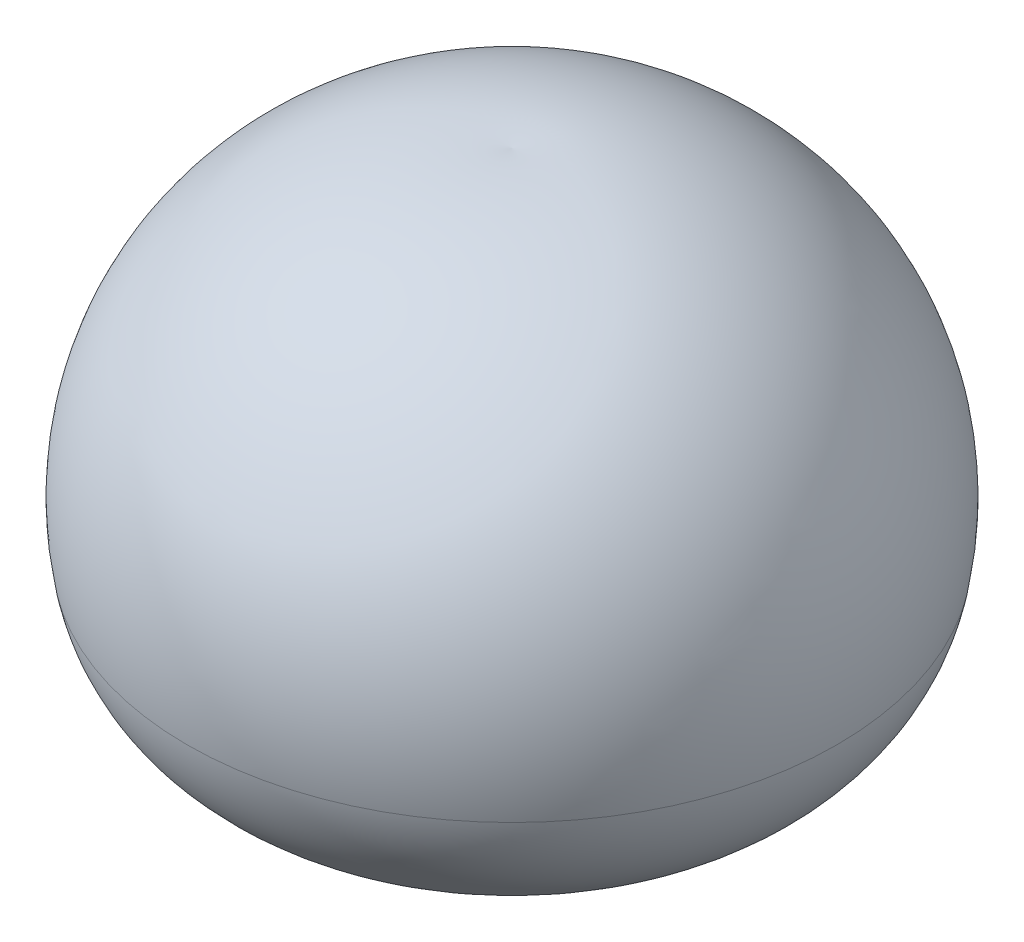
from build123d import *


with BuildPart() as part:
    # Sketch 1 → Revolve 1 (revolve)
    with BuildSketch(Plane.XY):
        with BuildLine():
            Line((0, -83.223660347), (0, -515.945433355))
            ThreePointArc((0, -515.945433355), (116.29966167, -672.560880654), (250, -814.610974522))
            ThreePointArc((250, -814.610974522), (1928.780277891, -1188.32558816), (3053.717135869, 112.629022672))
            ThreePointArc((3053.717135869, 112.629022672), (2348.37139147, 2531.076387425), (0, 3442.971163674))
            Line((0, 3442.971163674), (0, 1817.413932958))
            ThreePointArc((0, 1817.413932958), (290.778886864, 1582.375885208), (522.253742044, 1288.752595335))
            ThreePointArc((522.253742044, 1288.752595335), (936.078361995, 345.838780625), (0, -83.223660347))
        make_face()
    revolve(axis=Axis((0, 4105.814362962, 0), (0, -1, 0)))


solid = part.part
